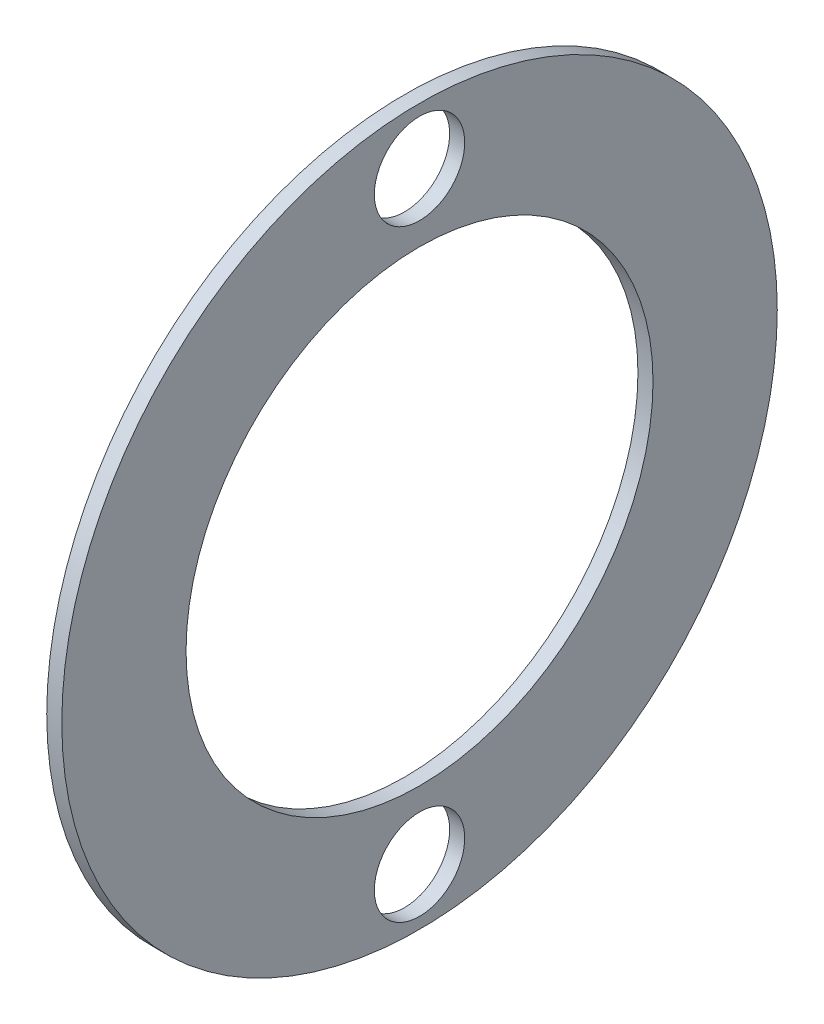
from build123d import *

# Parameters (mm, degrees)
SKETCH2_W                = 2
SKETCH2_H                = 47.5
CUT_EXTRUDE1_REACH       = 69.205
SKETCH5_R                = 6
CUT_EXTRUDE2_REACH       = 69.205
SKETCH6_R                = 31
PATTERN_CIRCULAR_1_COUNT = 2


with BuildPart() as part:
    # Sketch2 → Revolve1 (revolve)
    with BuildSketch(Plane.XY, mode=Mode.PRIVATE) as revolve1_sk:
        with Locations((1, 23.75)):
            Rectangle(SKETCH2_W, SKETCH2_H)
    revolve(revolve1_sk.sketch.rotate(Axis((29.906992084, 0, 0), (-1, 0, 0)), 90), axis=Axis((29.906992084, 0, 0), (-1, 0, 0)))

    # Sketch5 → Cut-Extrude1 (cut, up to next)
    with BuildSketch(Plane.ZY, mode=Mode.PRIVATE) as cut_extrude1_sk1:
        with Locations((0, 40)):
            Circle(SKETCH5_R)
    cut_extrude1_tool1 = extrude(cut_extrude1_sk1.sketch, amount=-CUT_EXTRUDE1_REACH, mode=Mode.PRIVATE) & part.part
    cut_extrude1 = cut_extrude1_tool1.solids().sort_by_distance((0, 40, 0))[0]
    add(cut_extrude1, mode=Mode.SUBTRACT)

    # Sketch6 → Cut-Extrude2 (cut, up to next)
    with BuildSketch(Plane.ZY, mode=Mode.PRIVATE) as cut_extrude2_sk1:
        Circle(SKETCH6_R)
    cut_extrude2_tool1 = extrude(cut_extrude2_sk1.sketch, amount=-CUT_EXTRUDE2_REACH, mode=Mode.PRIVATE) & part.part
    add(cut_extrude2_tool1.solids().sort_by_distance((0, 0, 0))[0], mode=Mode.SUBTRACT)

    # Pattern Circular 1: Cut-Extrude1 ×2 about axis
    pattern_circular_1_axis = Axis((0, 0, 0), (1, 0, 0))
    for i in range(1, PATTERN_CIRCULAR_1_COUNT):
        add(cut_extrude1.rotate(pattern_circular_1_axis, i * 360 / PATTERN_CIRCULAR_1_COUNT), mode=Mode.SUBTRACT)


solid = part.part
